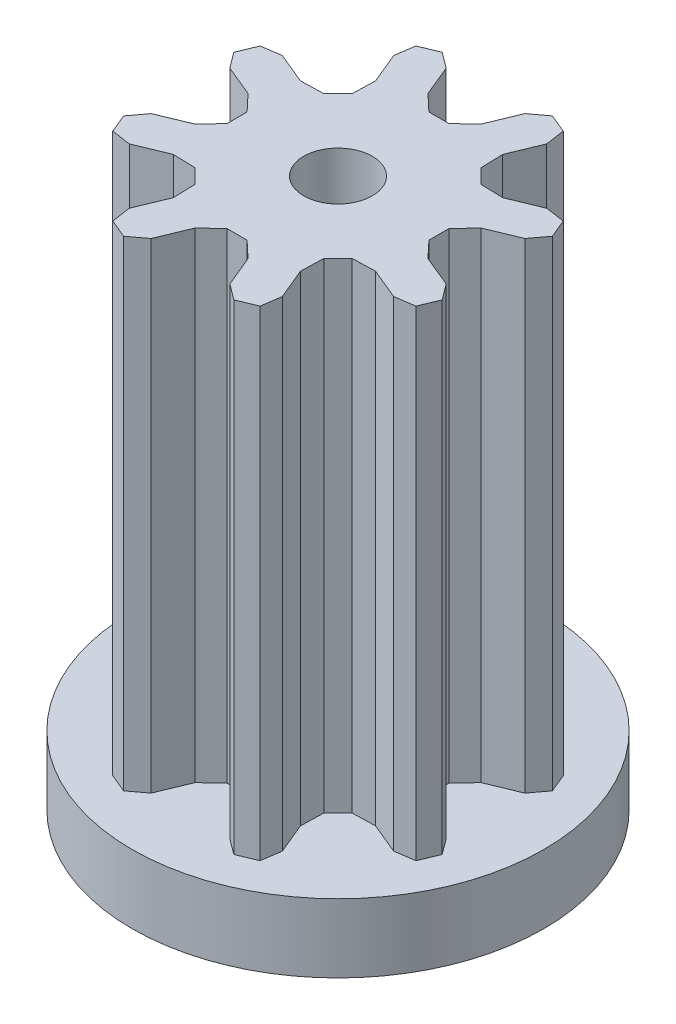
from build123d import *

# Parameters (mm, degrees)
SKETCH1_W          = 2.5
SKETCH1_H          = 8
SKETCH3_R          = 3
CUT_EXTRUDE1_DEPTH = 7


with BuildPart() as part:
    # Sketch1 → Revolve1 (revolve)
    with BuildSketch(Plane.XY, mode=Mode.PRIVATE) as revolve1_sk:
        with Locations((1.75, 4)):
            Rectangle(SKETCH1_W, SKETCH1_H)
    revolve(revolve1_sk.sketch.rotate(Axis((0, -3.168577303, 0), (0, 1, 0)), 90), axis=Axis((0, -3.168577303, 0), (0, 1, 0)))

    # Sketch3 → Cut-Extrude1 (cut)
    with BuildSketch(Plane(origin=(0, 8, 0), x_dir=(-1, 0, 0), z_dir=(0, 1, 0))):
        with Locations(Location((0, 0, 0), (0, 0, 270))):
            Circle(SKETCH3_R)
        Polygon((1.073505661, 2.20932524), (0.80314573, 2.321311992), (0.574133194, 2.150773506), (0.386468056, 1.697709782), (0.146317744, 1.471177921), (-0.146317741, 1.471177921), (-0.386468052, 1.697709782), (-0.57413319, 2.150773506), (-0.803145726, 2.321311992), (-1.073505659, 2.209325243), (-1.114853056, 1.926800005), (-0.927187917, 1.473736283), (-0.936817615, 1.143742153), (-1.143742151, 0.936817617), (-1.47373628, 0.927187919), (-1.926800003, 1.114853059), (-2.20932524, 1.073505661), (-2.321311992, 0.80314573), (-2.150773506, 0.574133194), (-1.697709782, 0.386468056), (-1.471177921, 0.146317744), (-1.471177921, -0.146317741), (-1.697709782, -0.386468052), (-2.150773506, -0.57413319), (-2.321311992, -0.803145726), (-2.209325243, -1.073505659), (-1.926800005, -1.114853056), (-1.473736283, -0.927187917), (-1.143742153, -0.936817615), (-0.936817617, -1.143742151), (-0.927187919, -1.47373628), (-1.114853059, -1.926800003), (-1.073505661, -2.20932524), (-0.80314573, -2.321311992), (-0.574133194, -2.150773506), (-0.386468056, -1.697709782), (-0.146317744, -1.471177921), (0.146317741, -1.471177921), (0.386468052, -1.697709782), (0.57413319, -2.150773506), (0.803145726, -2.321311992), (1.073505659, -2.209325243), (1.114853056, -1.926800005), (0.927187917, -1.473736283), (0.936817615, -1.143742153), (1.143742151, -0.936817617), (1.47373628, -0.927187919), (1.926800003, -1.114853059), (2.20932524, -1.073505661), (2.321311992, -0.80314573), (2.150773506, -0.574133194), (1.697709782, -0.386468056), (1.471177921, -0.146317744), (1.471177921, 0.146317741), (1.697709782, 0.386468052), (2.150773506, 0.57413319), (2.321311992, 0.803145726), (2.209325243, 1.073505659), (1.926800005, 1.114853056), (1.473736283, 0.927187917), (1.143742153, 0.936817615), (0.936817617, 1.143742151), (0.927187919, 1.47373628), (1.114853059, 1.926800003), align=None, mode=Mode.SUBTRACT)
    extrude(amount=-CUT_EXTRUDE1_DEPTH, mode=Mode.SUBTRACT)


solid = part.part
